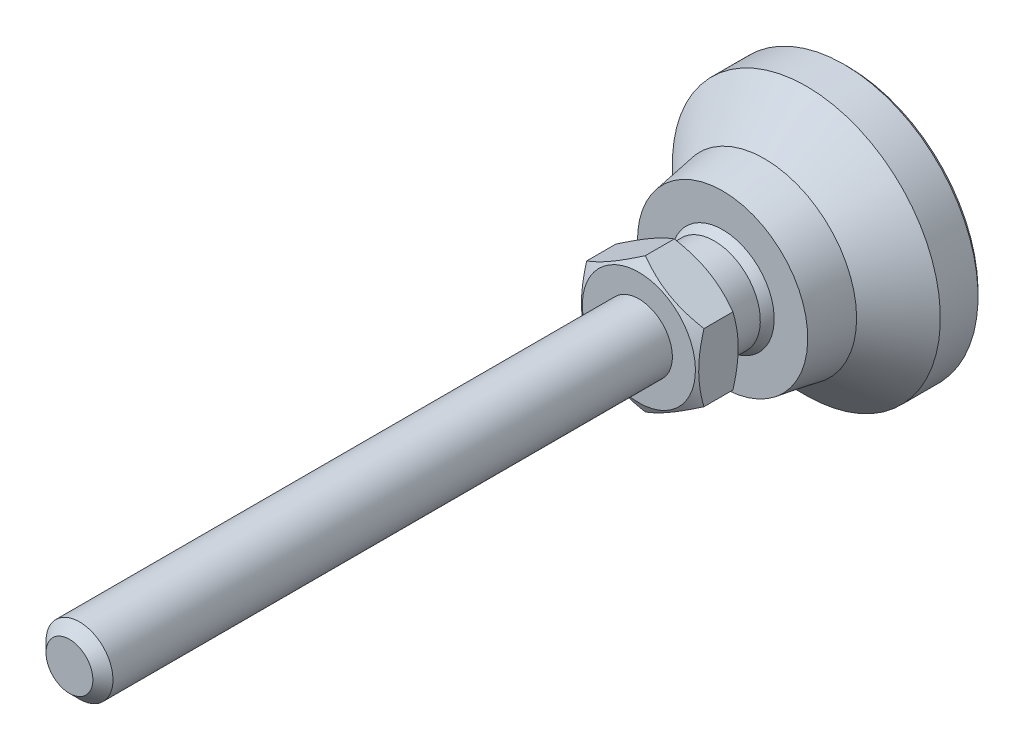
ISO-10303-21;
HEADER;
FILE_DESCRIPTION(('STEP AP214'),'2;1');
FILE_NAME('part.step','',(''),(''),'','','');
FILE_SCHEMA(('AUTOMOTIVE_DESIGN { 1 0 10303 214 1 1 1 1 }'));
ENDSEC;
DATA;
#1=APPLICATION_CONTEXT('core data for automotive mechanical design processes');
#2=APPLICATION_PROTOCOL_DEFINITION('international standard','automotive_design',2000,#1);
#3=PRODUCT_CONTEXT('',#1,'mechanical');
#4=PRODUCT('Part','Part','',(#3));
#5=PRODUCT_RELATED_PRODUCT_CATEGORY('part','',(#4));
#6=PRODUCT_DEFINITION_FORMATION('','',#4);
#7=PRODUCT_DEFINITION_CONTEXT('part definition',#1,'design');
#8=PRODUCT_DEFINITION('design','',#6,#7);
#9=PRODUCT_DEFINITION_SHAPE('','',#8);
#10=(LENGTH_UNIT() NAMED_UNIT(*) SI_UNIT(.MILLI.,.METRE.));
#11=(NAMED_UNIT(*) PLANE_ANGLE_UNIT() SI_UNIT($,.RADIAN.));
#12=(NAMED_UNIT(*) SI_UNIT($,.STERADIAN.) SOLID_ANGLE_UNIT());
#13=UNCERTAINTY_MEASURE_WITH_UNIT(LENGTH_MEASURE(1.E-05),#10,'distance_accuracy_value','');
#14=(GEOMETRIC_REPRESENTATION_CONTEXT(3) GLOBAL_UNCERTAINTY_ASSIGNED_CONTEXT((#13)) GLOBAL_UNIT_ASSIGNED_CONTEXT((#10,
#11,#12)) REPRESENTATION_CONTEXT('',''));
#15=CARTESIAN_POINT('',(0.,0.,0.));
#16=DIRECTION('',(0.,0.,1.));
#17=DIRECTION('',(1.,0.,0.));
#18=AXIS2_PLACEMENT_3D('',#15,#16,#17);
#19=CARTESIAN_POINT('',(0.,0.,0.));
#20=DIRECTION('',(0.,0.,-1.));
#21=DIRECTION('',(0.,1.,0.));
#22=AXIS2_PLACEMENT_3D('',#19,#20,#21);
#23=CYLINDRICAL_SURFACE('',#22,5.49999999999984);
#24=CARTESIAN_POINT('',(0.,0.,20.));
#25=DIRECTION('',(0.,0.,-1.));
#26=DIRECTION('',(0.,1.,0.));
#27=AXIS2_PLACEMENT_3D('',#24,#25,#26);
#28=CIRCLE('',#27,5.49999999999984);
#29=CARTESIAN_POINT('',(0.,5.49999999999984,20.));
#30=VERTEX_POINT('',#29);
#31=EDGE_CURVE('E111',#30,#30,#28,.T.);
#32=ORIENTED_EDGE('',*,*,#31,.T.);
#33=EDGE_LOOP('',(#32));
#34=FACE_BOUND('',#33,.T.);
#35=CARTESIAN_POINT('',(0.,0.,16.0000000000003));
#36=DIRECTION('',(0.,0.,1.));
#37=DIRECTION('',(0.,-1.,0.));
#38=AXIS2_PLACEMENT_3D('',#35,#36,#37);
#39=CIRCLE('',#38,5.49999999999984);
#40=CARTESIAN_POINT('',(-5.49999999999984,0.,16.0000000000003));
#41=VERTEX_POINT('',#40);
#42=EDGE_CURVE('E113',#41,#41,#39,.T.);
#43=ORIENTED_EDGE('',*,*,#42,.T.);
#44=EDGE_LOOP('',(#43));
#45=FACE_BOUND('',#44,.T.);
#46=ADVANCED_FACE('F14',(#34,#45),#23,.T.);
#47=CARTESIAN_POINT('',(0.,0.,11.6698729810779));
#48=DIRECTION('',(0.,0.,1.));
#49=DIRECTION('',(-1.,0.,0.));
#50=AXIS2_PLACEMENT_3D('',#47,#48,#49);
#51=SPHERICAL_SURFACE('',#50,7.);
#52=CARTESIAN_POINT('',(0.,0.,15.));
#53=DIRECTION('',(0.,0.,1.));
#54=DIRECTION('',(0.,-1.,0.));
#55=AXIS2_PLACEMENT_3D('',#52,#53,#54);
#56=CIRCLE('',#55,6.15713034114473);
#57=CARTESIAN_POINT('',(-6.15713034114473,0.,15.));
#58=VERTEX_POINT('',#57);
#59=EDGE_CURVE('E118',#58,#58,#56,.T.);
#60=CARTESIAN_POINT('',(-5.49999999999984,0.,16.0000000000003));
#61=CARTESIAN_POINT('',(-5.50771979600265,0.,15.9901945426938));
#62=CARTESIAN_POINT('',(-5.51541336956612,0.,15.9803684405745));
#63=CARTESIAN_POINT('',(-5.53074785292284,0.,15.9606752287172));
#64=CARTESIAN_POINT('',(-5.53838876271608,0.,15.9508081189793));
#65=CARTESIAN_POINT('',(-5.55361769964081,0.,15.9310331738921));
#66=CARTESIAN_POINT('',(-5.56120572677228,0.,15.9211253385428));
#67=CARTESIAN_POINT('',(-5.57632868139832,0.,15.9012692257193));
#68=CARTESIAN_POINT('',(-5.58386360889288,0.,15.8913209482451));
#69=CARTESIAN_POINT('',(-5.59888014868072,0.,15.871384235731));
#70=CARTESIAN_POINT('',(-5.60636176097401,0.,15.8613958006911));
#71=CARTESIAN_POINT('',(-5.62127145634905,0.,15.841379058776));
#72=CARTESIAN_POINT('',(-5.62869953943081,0.,15.8313507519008));
#73=CARTESIAN_POINT('',(-5.64350196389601,0.,15.81125455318));
#74=CARTESIAN_POINT('',(-5.65087630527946,0.,15.8011866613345));
#75=CARTESIAN_POINT('',(-5.66557103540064,0.,15.781011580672));
#76=CARTESIAN_POINT('',(-5.67289142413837,0.,15.770904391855));
#77=CARTESIAN_POINT('',(-5.68747803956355,0.,15.7506510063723));
#78=CARTESIAN_POINT('',(-5.69474426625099,0.,15.7405048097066));
#79=CARTESIAN_POINT('',(-5.70922234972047,0.,15.7201736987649));
#80=CARTESIAN_POINT('',(-5.7164342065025,0.,15.7099887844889));
#81=CARTESIAN_POINT('',(-5.7308033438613,0.,15.6895805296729));
#82=CARTESIAN_POINT('',(-5.73796062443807,0.,15.6793571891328));
#83=CARTESIAN_POINT('',(-5.75222040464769,0.,15.6588723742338));
#84=CARTESIAN_POINT('',(-5.75932290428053,0.,15.6486108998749));
#85=CARTESIAN_POINT('',(-5.77347291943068,0.,15.6280501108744));
#86=CARTESIAN_POINT('',(-5.78052043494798,0.,15.6177507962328));
#87=CARTESIAN_POINT('',(-5.79456028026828,0.,15.5971146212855));
#88=CARTESIAN_POINT('',(-5.80155261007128,0.,15.5867777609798));
#89=CARTESIAN_POINT('',(-5.81548188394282,0.,15.5660667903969));
#90=CARTESIAN_POINT('',(-5.82241882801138,0.,15.5556926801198));
#91=CARTESIAN_POINT('',(-5.83623713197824,0.,15.5349075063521));
#92=CARTESIAN_POINT('',(-5.84311849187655,0.,15.5244964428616));
#93=CARTESIAN_POINT('',(-5.85682543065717,0.,15.5036376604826));
#94=CARTESIAN_POINT('',(-5.86365100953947,0.,15.493189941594));
#95=CARTESIAN_POINT('',(-5.87724619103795,0.,15.4722581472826));
#96=CARTESIAN_POINT('',(-5.88401579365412,0.,15.4617740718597));
#97=CARTESIAN_POINT('',(-5.89749882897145,0.,15.4407698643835));
#98=CARTESIAN_POINT('',(-5.90421226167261,0.,15.4302497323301));
#99=CARTESIAN_POINT('',(-5.91758276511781,0.,15.4091737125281));
#100=CARTESIAN_POINT('',(-5.92423983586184,0.,15.3986178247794));
#101=CARTESIAN_POINT('',(-5.93749742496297,0.,15.3774705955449));
#102=CARTESIAN_POINT('',(-5.94409794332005,0.,15.366879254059));
#103=CARTESIAN_POINT('',(-5.95724223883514,0.,15.3456614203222));
#104=CARTESIAN_POINT('',(-5.96378601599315,0.,15.3350349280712));
#105=CARTESIAN_POINT('',(-5.9768166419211,0.,15.313747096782));
#106=CARTESIAN_POINT('',(-5.98330349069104,0.,15.3030857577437));
#107=CARTESIAN_POINT('',(-5.99622007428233,0.,15.2817285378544));
#108=CARTESIAN_POINT('',(-6.00264980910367,0.,15.2710326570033));
#109=CARTESIAN_POINT('',(-6.015451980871,0.,15.2496066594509));
#110=CARTESIAN_POINT('',(-6.02182441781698,0.,15.2388765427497));
#111=CARTESIAN_POINT('',(-6.034511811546,0.,15.217382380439));
#112=CARTESIAN_POINT('',(-6.04082676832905,0.,15.2066183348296));
#113=CARTESIAN_POINT('',(-6.05339902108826,0.,15.1850566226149));
#114=CARTESIAN_POINT('',(-6.05965631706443,0.,15.1742589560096));
#115=CARTESIAN_POINT('',(-6.07211306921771,0.,15.1526303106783));
#116=CARTESIAN_POINT('',(-6.07831252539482,0.,15.1417993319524));
#117=CARTESIAN_POINT('',(-6.09065342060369,0.,15.1201043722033));
#118=CARTESIAN_POINT('',(-6.09679485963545,0.,15.1092403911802));
#119=CARTESIAN_POINT('',(-6.10901954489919,0.,15.0874797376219));
#120=CARTESIAN_POINT('',(-6.11510279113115,0.,15.0765830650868));
#121=CARTESIAN_POINT('',(-6.12721091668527,0.,15.054757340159));
#122=CARTESIAN_POINT('',(-6.13323579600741,0.,15.0438282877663));
#123=CARTESIAN_POINT('',(-6.14522701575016,0.,15.0219381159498));
#124=CARTESIAN_POINT('',(-6.15119335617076,0.,15.010976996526));
#125=CARTESIAN_POINT('',(-6.15713034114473,0.,15.));
#126=B_SPLINE_CURVE_WITH_KNOTS('',3,(#60,#61,#62,#63,#64,#65,#66,#67,#68,#69,#70,#71,#72,#73,
#74,#75,#76,#77,#78,#79,#80,#81,#82,#83,#84,#85,#86,#87,#88,#89,#90,#91,#92,#93,#94,#95,#96,#97,
#98,#99,#100,#101,#102,#103,#104,#105,#106,#107,#108,#109,#110,#111,#112,#113,#114,#115,#116,
#117,#118,#119,#120,#121,#122,#123,#124,#125),.UNSPECIFIED.,.F.,.F.,(4,2,2,2,2,2,2,2,2,2,2,2,2,
2,2,2,2,2,2,2,2,2,2,2,2,2,2,2,2,2,2,2,4),(0.,0.0374389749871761,0.0748779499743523,
0.112316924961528,0.149755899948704,0.18719487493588,0.224633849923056,0.26207282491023,
0.299511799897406,0.336950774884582,0.374389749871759,0.411828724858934,0.449267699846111,
0.486706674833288,0.524145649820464,0.56158462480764,0.599023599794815,0.636462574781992,
0.673901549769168,0.711340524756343,0.74877949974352,0.786218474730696,0.823657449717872,
0.861096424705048,0.898535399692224,0.9359743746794,0.973413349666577,1.01085232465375,
1.04829129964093,1.0857302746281,1.12316924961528,1.16060822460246,1.19804719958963),.UNSPECIFIED.);
#127=EDGE_CURVE('BSEAM156',#41,#58,#126,.T.);
#128=ORIENTED_EDGE('',*,*,#42,.F.);
#129=ORIENTED_EDGE('',*,*,#59,.T.);
#130=ORIENTED_EDGE('',*,*,#127,.T.);
#131=ORIENTED_EDGE('',*,*,#127,.F.);
#132=EDGE_LOOP('',(#128,#130,#129,#131));
#133=FACE_BOUND('',#132,.T.);
#134=ADVANCED_FACE('F156',(#133),#51,.T.);
#135=CARTESIAN_POINT('',(-15.5,0.,0.));
#136=DIRECTION('',(0.,0.,1.));
#137=DIRECTION('',(0.,-1.,0.));
#138=AXIS2_PLACEMENT_3D('',#135,#136,#137);
#139=PLANE('',#138);
#140=CARTESIAN_POINT('',(0.,0.,0.));
#141=DIRECTION('',(0.,0.,-1.));
#142=DIRECTION('',(0.,1.,0.));
#143=AXIS2_PLACEMENT_3D('',#140,#141,#142);
#144=CIRCLE('',#143,15.5);
#145=CARTESIAN_POINT('',(0.,15.5,0.));
#146=VERTEX_POINT('',#145);
#147=EDGE_CURVE('E87',#146,#146,#144,.T.);
#148=ORIENTED_EDGE('',*,*,#147,.T.);
#149=EDGE_LOOP('',(#148));
#150=FACE_BOUND('',#149,.T.);
#151=ADVANCED_FACE('F161',(#150),#139,.F.);
#152=CARTESIAN_POINT('',(0.,0.,0.500000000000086));
#153=DIRECTION('',(0.,0.,1.));
#154=DIRECTION('',(0.,-1.,0.));
#155=AXIS2_PLACEMENT_3D('',#152,#153,#154);
#156=CONICAL_SURFACE('',#155,16.,0.785398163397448);
#157=ORIENTED_EDGE('',*,*,#147,.F.);
#158=EDGE_LOOP('',(#157));
#159=FACE_BOUND('',#158,.T.);
#160=CARTESIAN_POINT('',(0.,0.,0.500000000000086));
#161=DIRECTION('',(0.,0.,-1.));
#162=DIRECTION('',(0.,1.,0.));
#163=AXIS2_PLACEMENT_3D('',#160,#161,#162);
#164=CIRCLE('',#163,16.);
#165=CARTESIAN_POINT('',(0.,16.,0.500000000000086));
#166=VERTEX_POINT('',#165);
#167=EDGE_CURVE('E90',#166,#166,#164,.T.);
#168=ORIENTED_EDGE('',*,*,#167,.T.);
#169=EDGE_LOOP('',(#168));
#170=FACE_BOUND('',#169,.T.);
#171=ADVANCED_FACE('F171',(#159,#170),#156,.T.);
#172=CARTESIAN_POINT('',(0.,0.,0.));
#173=DIRECTION('',(0.,0.,-1.));
#174=DIRECTION('',(0.,1.,0.));
#175=AXIS2_PLACEMENT_3D('',#172,#173,#174);
#176=CYLINDRICAL_SURFACE('',#175,16.);
#177=ORIENTED_EDGE('',*,*,#167,.F.);
#178=EDGE_LOOP('',(#177));
#179=FACE_BOUND('',#178,.T.);
#180=CARTESIAN_POINT('',(0.,0.,5.00000000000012));
#181=DIRECTION('',(0.,0.,-1.));
#182=DIRECTION('',(0.,1.,0.));
#183=AXIS2_PLACEMENT_3D('',#180,#181,#182);
#184=CIRCLE('',#183,16.);
#185=CARTESIAN_POINT('',(0.,16.,5.00000000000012));
#186=VERTEX_POINT('',#185);
#187=EDGE_CURVE('E107',#186,#186,#184,.T.);
#188=ORIENTED_EDGE('',*,*,#187,.T.);
#189=EDGE_LOOP('',(#188));
#190=FACE_BOUND('',#189,.T.);
#191=ADVANCED_FACE('F167',(#179,#190),#176,.T.);
#192=CARTESIAN_POINT('',(0.,0.,10.));
#193=DIRECTION('',(0.,0.,-1.));
#194=DIRECTION('',(0.,1.,0.));
#195=AXIS2_PLACEMENT_3D('',#192,#193,#194);
#196=CONICAL_SURFACE('',#195,11.,0.785398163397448);
#197=ORIENTED_EDGE('',*,*,#187,.F.);
#198=EDGE_LOOP('',(#197));
#199=FACE_BOUND('',#198,.T.);
#200=CARTESIAN_POINT('',(0.,0.,10.));
#201=DIRECTION('',(0.,0.,-1.));
#202=DIRECTION('',(0.,1.,0.));
#203=AXIS2_PLACEMENT_3D('',#200,#201,#202);
#204=CIRCLE('',#203,11.);
#205=CARTESIAN_POINT('',(0.,11.,10.));
#206=VERTEX_POINT('',#205);
#207=EDGE_CURVE('E28',#206,#206,#204,.T.);
#208=ORIENTED_EDGE('',*,*,#207,.T.);
#209=EDGE_LOOP('',(#208));
#210=FACE_BOUND('',#209,.T.);
#211=ADVANCED_FACE('F150',(#199,#210),#196,.T.);
#212=CARTESIAN_POINT('',(0.,0.,16.));
#213=DIRECTION('',(0.,0.,-1.));
#214=DIRECTION('',(0.,1.,0.));
#215=AXIS2_PLACEMENT_3D('',#212,#213,#214);
#216=CONICAL_SURFACE('',#215,10.,0.165148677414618);
#217=ORIENTED_EDGE('',*,*,#207,.F.);
#218=EDGE_LOOP('',(#217));
#219=FACE_BOUND('',#218,.T.);
#220=CARTESIAN_POINT('',(0.,0.,15.));
#221=DIRECTION('',(0.,0.,-1.));
#222=DIRECTION('',(0.,1.,0.));
#223=AXIS2_PLACEMENT_3D('',#220,#221,#222);
#224=CIRCLE('',#223,10.1666666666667);
#225=CARTESIAN_POINT('',(0.,10.1666666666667,15.));
#226=VERTEX_POINT('',#225);
#227=EDGE_CURVE('E95',#226,#226,#224,.T.);
#228=ORIENTED_EDGE('',*,*,#227,.T.);
#229=EDGE_LOOP('',(#228));
#230=FACE_BOUND('',#229,.T.);
#231=ADVANCED_FACE('F135',(#219,#230),#216,.T.);
#232=CARTESIAN_POINT('',(-10.1666666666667,0.,15.));
#233=DIRECTION('',(0.,0.,1.));
#234=DIRECTION('',(0.,-1.,0.));
#235=AXIS2_PLACEMENT_3D('',#232,#233,#234);
#236=PLANE('',#235);
#237=ORIENTED_EDGE('',*,*,#227,.F.);
#238=EDGE_LOOP('',(#237));
#239=FACE_BOUND('',#238,.T.);
#240=ORIENTED_EDGE('',*,*,#59,.F.);
#241=EDGE_LOOP('',(#240));
#242=FACE_BOUND('',#241,.T.);
#243=ADVANCED_FACE('F137',(#239,#242),#236,.T.);
#244=CARTESIAN_POINT('',(0.,-8.08290376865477,20.));
#245=DIRECTION('',(0.,0.,-1.));
#246=DIRECTION('',(0.,1.,0.));
#247=AXIS2_PLACEMENT_3D('',#244,#245,#246);
#248=PLANE('',#247);
#249=CARTESIAN_POINT('',(0.,0.,20.));
#250=DIRECTION('',(0.,0.,1.));
#251=DIRECTION('',(0.,-1.,0.));
#252=AXIS2_PLACEMENT_3D('',#249,#250,#251);
#253=CIRCLE('',#252,6.75);
#254=CARTESIAN_POINT('',(0.,-6.75,20.));
#255=VERTEX_POINT('',#254);
#256=EDGE_CURVE('E81',#255,#255,#253,.T.);
#257=ORIENTED_EDGE('',*,*,#256,.F.);
#258=EDGE_LOOP('',(#257));
#259=FACE_BOUND('',#258,.T.);
#260=ORIENTED_EDGE('',*,*,#31,.F.);
#261=EDGE_LOOP('',(#260));
#262=FACE_BOUND('',#261,.T.);
#263=ADVANCED_FACE('F140',(#259,#262),#248,.T.);
#264=CARTESIAN_POINT('',(0.,0.,20.));
#265=DIRECTION('',(0.,0.,1.));
#266=DIRECTION('',(0.,-1.,0.));
#267=AXIS2_PLACEMENT_3D('',#264,#265,#266);
#268=CONICAL_SURFACE('',#267,6.75,1.0471975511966);
#269=CARTESIAN_POINT('',(7.0002,-4.04133641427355,20.7696190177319));
#270=CARTESIAN_POINT('',(6.84633209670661,-4.13017208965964,20.7183374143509));
#271=CARTESIAN_POINT('',(6.69189049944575,-4.21933898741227,20.669383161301));
#272=CARTESIAN_POINT('',(6.38175307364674,-4.3983969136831,20.5767703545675));
#273=CARTESIAN_POINT('',(6.22605673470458,-4.4882882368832,20.5331140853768));
#274=CARTESIAN_POINT('',(5.75647483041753,-4.7594014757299,20.4109491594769));
#275=CARTESIAN_POINT('',(5.4407356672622,-4.94169356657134,20.3414631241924));
#276=CARTESIAN_POINT('',(4.96823775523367,-5.21449036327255,20.2599825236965));
#277=CARTESIAN_POINT('',(4.81289077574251,-5.30417998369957,20.2367710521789));
#278=CARTESIAN_POINT('',(4.50149488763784,-5.48396448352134,20.1978487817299));
#279=CARTESIAN_POINT('',(4.34544604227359,-5.57405932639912,20.1821373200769));
#280=CARTESIAN_POINT('',(4.03307732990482,-5.75440548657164,20.1586154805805));
#281=CARTESIAN_POINT('',(3.87675797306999,-5.84465650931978,20.1507961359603));
#282=CARTESIAN_POINT('',(3.56398349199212,-6.02523694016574,20.1432178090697));
#283=CARTESIAN_POINT('',(3.40752837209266,-6.11556634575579,20.1434585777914));
#284=CARTESIAN_POINT('',(2.97889312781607,-6.36303901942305,20.155197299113));
#285=CARTESIAN_POINT('',(2.7068533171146,-6.52010127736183,20.1749033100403));
#286=CARTESIAN_POINT('',(2.16458055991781,-6.83318259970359,20.2373910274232));
#287=CARTESIAN_POINT('',(1.89434952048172,-6.98920056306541,20.2801940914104));
#288=CARTESIAN_POINT('',(1.35098545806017,-7.30291195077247,20.3871892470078));
#289=CARTESIAN_POINT('',(1.07792099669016,-7.46056579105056,20.4518346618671));
#290=CARTESIAN_POINT('',(0.535864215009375,-7.77352241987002,20.5985536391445));
#291=CARTESIAN_POINT('',(0.266864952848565,-7.92882921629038,20.680592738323));
#292=CARTESIAN_POINT('',(-0.000199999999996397,-8.08301923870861,20.7696190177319));
#293=B_SPLINE_CURVE_WITH_KNOTS('',3,(#269,#270,#271,#272,#273,#274,#275,#276,#277,#278,#279,
#280,#281,#282,#283,#284,#285,#286,#287,#288,#289,#290,#291,#292),.UNSPECIFIED.,.F.,.F.,(4,2,2,
2,2,2,2,2,2,2,2,4),(0.,0.554727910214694,1.10969417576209,2.2219327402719,2.76443041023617,
3.30688013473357,3.8487128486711,4.39052882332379,5.33376515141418,6.27787517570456,
7.24292418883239,8.20607866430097),.UNSPECIFIED.);
#294=CARTESIAN_POINT('',(7.,-4.04145188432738,20.7695523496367));
#295=VERTEX_POINT('',#294);
#296=CARTESIAN_POINT('',(0.,-8.08290376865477,20.7695523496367));
#297=VERTEX_POINT('',#296);
#298=EDGE_CURVE('E34',#295,#297,#293,.T.);
#299=ORIENTED_EDGE('',*,*,#298,.T.);
#300=CARTESIAN_POINT('',(0.000200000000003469,-8.0830192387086,20.7696190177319));
#301=CARTESIAN_POINT('',(-0.153667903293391,-7.99418356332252,20.7183374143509));
#302=CARTESIAN_POINT('',(-0.308109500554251,-7.90501666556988,20.669383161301));
#303=CARTESIAN_POINT('',(-0.618246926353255,-7.72595873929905,20.5767703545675));
#304=CARTESIAN_POINT('',(-0.773943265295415,-7.63606741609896,20.5331140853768));
#305=CARTESIAN_POINT('',(-1.24352516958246,-7.36495417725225,20.4109491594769));
#306=CARTESIAN_POINT('',(-1.5592643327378,-7.18266208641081,20.3414631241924));
#307=CARTESIAN_POINT('',(-2.03176224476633,-6.90986528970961,20.2599825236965));
#308=CARTESIAN_POINT('',(-2.18710922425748,-6.82017566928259,20.2367710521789));
#309=CARTESIAN_POINT('',(-2.49850511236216,-6.64039116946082,20.1978487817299));
#310=CARTESIAN_POINT('',(-2.6545539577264,-6.55029632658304,20.1821373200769));
#311=CARTESIAN_POINT('',(-2.96692267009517,-6.36995016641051,20.1586154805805));
#312=CARTESIAN_POINT('',(-3.12324202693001,-6.27969914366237,20.1507961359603));
#313=CARTESIAN_POINT('',(-3.43601650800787,-6.09911871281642,20.1432178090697));
#314=CARTESIAN_POINT('',(-3.59247162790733,-6.00878930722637,20.1434585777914));
#315=CARTESIAN_POINT('',(-4.02110687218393,-5.76131663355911,20.155197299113));
#316=CARTESIAN_POINT('',(-4.29314668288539,-5.60425437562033,20.1749033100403));
#317=CARTESIAN_POINT('',(-4.83541944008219,-5.29117305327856,20.2373910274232));
#318=CARTESIAN_POINT('',(-5.10565047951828,-5.13515508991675,20.2801940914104));
#319=CARTESIAN_POINT('',(-5.64901454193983,-4.82144370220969,20.3871892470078));
#320=CARTESIAN_POINT('',(-5.92207900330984,-4.6637898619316,20.4518346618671));
#321=CARTESIAN_POINT('',(-6.46413578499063,-4.35083323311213,20.5985536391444));
#322=CARTESIAN_POINT('',(-6.73313504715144,-4.19552643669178,20.680592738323));
#323=CARTESIAN_POINT('',(-7.0002,-4.04133641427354,20.7696190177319));
#324=B_SPLINE_CURVE_WITH_KNOTS('',3,(#300,#301,#302,#303,#304,#305,#306,#307,#308,#309,#310,
#311,#312,#313,#314,#315,#316,#317,#318,#319,#320,#321,#322,#323),.UNSPECIFIED.,.F.,.F.,(4,2,2,
2,2,2,2,2,2,2,2,4),(0.,0.554727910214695,1.10969417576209,2.2219327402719,2.76443041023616,
3.30688013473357,3.84871284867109,4.39052882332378,5.33376515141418,6.27787517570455,
7.2429241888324,8.20607866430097),.UNSPECIFIED.);
#325=CARTESIAN_POINT('',(-7.,-4.04145188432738,20.7695523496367));
#326=VERTEX_POINT('',#325);
#327=EDGE_CURVE('E9',#297,#326,#324,.T.);
#328=ORIENTED_EDGE('',*,*,#327,.T.);
#329=CARTESIAN_POINT('',(-7.,10.818512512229,23.5424244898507));
#330=CARTESIAN_POINT('',(-7.,10.513086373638,23.394415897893));
#331=CARTESIAN_POINT('',(-7.,10.2069550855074,23.2478373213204));
#332=CARTESIAN_POINT('',(-7.,9.5929070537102,22.9583452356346));
#333=CARTESIAN_POINT('',(-7.,9.28499003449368,22.8154323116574));
#334=CARTESIAN_POINT('',(-7.,8.66539093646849,22.5333495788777));
#335=CARTESIAN_POINT('',(-7.,8.35369746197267,22.3942047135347));
#336=CARTESIAN_POINT('',(-7.,7.72781834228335,22.1216594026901));
#337=CARTESIAN_POINT('',(-7.,7.413632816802,21.9882586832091));
#338=CARTESIAN_POINT('',(-7.,6.77227563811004,21.7246111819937));
#339=CARTESIAN_POINT('',(-7.,6.44500757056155,21.5945976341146));
#340=CARTESIAN_POINT('',(-7.,5.7866296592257,21.344501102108));
#341=CARTESIAN_POINT('',(-7.,5.45551938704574,21.2244192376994));
#342=CARTESIAN_POINT('',(-7.,4.78955817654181,20.9973662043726));
#343=CARTESIAN_POINT('',(-7.,4.4547164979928,20.8903681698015));
#344=CARTESIAN_POINT('',(-7.,3.78024246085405,20.6929392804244));
#345=CARTESIAN_POINT('',(-7.,3.44061165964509,20.6025031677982));
#346=CARTESIAN_POINT('',(-7.,2.75818647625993,20.4430474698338));
#347=CARTESIAN_POINT('',(-7.,2.4154196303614,20.3739132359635));
#348=CARTESIAN_POINT('',(-7.,1.89817810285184,20.2892002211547));
#349=CARTESIAN_POINT('',(-7.,1.72523606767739,20.2641261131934));
#350=CARTESIAN_POINT('',(-7.,1.37850513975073,20.2207999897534));
#351=CARTESIAN_POINT('',(-7.,1.20471633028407,20.2025473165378));
#352=CARTESIAN_POINT('',(-7.,0.858778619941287,20.1734546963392));
#353=CARTESIAN_POINT('',(-7.,0.68663754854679,20.1625220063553));
#354=CARTESIAN_POINT('',(-7.,0.342047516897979,20.1479433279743));
#355=CARTESIAN_POINT('',(-7.,0.169598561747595,20.1442972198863));
#356=CARTESIAN_POINT('',(-7.,-0.175299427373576,20.1443785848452));
#357=CARTESIAN_POINT('',(-7.,-0.347748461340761,20.1481060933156));
#358=CARTESIAN_POINT('',(-7.,-0.69233726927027,20.1628442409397));
#359=CARTESIAN_POINT('',(-7.,-0.864477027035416,20.173855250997));
#360=CARTESIAN_POINT('',(-7.,-1.27931862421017,20.208935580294));
#361=CARTESIAN_POINT('',(-7.,-1.52172905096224,20.2365237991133));
#362=CARTESIAN_POINT('',(-7.,-2.00471472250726,20.3046300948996));
#363=CARTESIAN_POINT('',(-7.,-2.24528970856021,20.3451499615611));
#364=CARTESIAN_POINT('',(-7.,-2.96400663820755,20.483955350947));
#365=CARTESIAN_POINT('',(-7.,-3.4388649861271,20.5994603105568));
#366=CARTESIAN_POINT('',(-7.,-4.14885738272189,20.7993038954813));
#367=CARTESIAN_POINT('',(-7.,-4.38768544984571,20.8712695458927));
#368=CARTESIAN_POINT('',(-7.,-4.86302113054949,21.0225627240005));
#369=CARTESIAN_POINT('',(-7.,-5.09952872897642,21.101890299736));
#370=CARTESIAN_POINT('',(-7.,-5.57030006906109,21.2666439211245));
#371=CARTESIAN_POINT('',(-7.,-5.80456454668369,21.3520678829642));
#372=CARTESIAN_POINT('',(-7.,-6.2711601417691,21.5280204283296));
#373=CARTESIAN_POINT('',(-7.,-6.50349128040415,21.6185489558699));
#374=CARTESIAN_POINT('',(-7.,-7.04574974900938,21.8356094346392));
#375=CARTESIAN_POINT('',(-7.,-7.35499166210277,21.9638503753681));
#376=CARTESIAN_POINT('',(-7.,-7.97089833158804,22.226395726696));
#377=CARTESIAN_POINT('',(-7.,-8.27756293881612,22.360700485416));
#378=CARTESIAN_POINT('',(-7.,-8.88878114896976,22.6341726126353));
#379=CARTESIAN_POINT('',(-7.,-9.19333433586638,22.7733409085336));
#380=CARTESIAN_POINT('',(-7.,-9.80062987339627,23.0555808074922));
#381=CARTESIAN_POINT('',(-7.,-10.1033721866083,23.1986524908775));
#382=CARTESIAN_POINT('',(-7.,-10.7076430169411,23.488121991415));
#383=CARTESIAN_POINT('',(-7.,-11.0091699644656,23.6345230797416));
#384=CARTESIAN_POINT('',(-7.,-11.6109362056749,23.9299505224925));
#385=CARTESIAN_POINT('',(-7.,-11.9111754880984,24.0789768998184));
#386=CARTESIAN_POINT('',(-7.,-12.8101895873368,24.5292664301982));
#387=CARTESIAN_POINT('',(-7.,-13.4073376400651,24.8337771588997));
#388=CARTESIAN_POINT('',(-7.,-14.5495136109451,25.4236329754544));
#389=CARTESIAN_POINT('',(-7.,-15.0947914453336,25.7084962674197));
#390=CARTESIAN_POINT('',(-7.,-16.1833163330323,26.2821180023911));
#391=CARTESIAN_POINT('',(-7.,-16.7265633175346,26.5708765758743));
#392=CARTESIAN_POINT('',(-7.,-17.8101621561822,27.1506673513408));
#393=CARTESIAN_POINT('',(-7.,-18.3505178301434,27.4416924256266));
#394=CARTESIAN_POINT('',(-7.,-19.4299272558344,28.0260796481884));
#395=CARTESIAN_POINT('',(-7.,-19.9689810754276,28.31944167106));
#396=CARTESIAN_POINT('',(-7.,-20.50755401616,28.6136779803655));
#397=B_SPLINE_CURVE_WITH_KNOTS('',3,(#329,#330,#331,#332,#333,#334,#335,#336,#337,#338,#339,
#340,#341,#342,#343,#344,#345,#346,#347,#348,#349,#350,#351,#352,#353,#354,#355,#356,#357,#358,
#359,#360,#361,#362,#363,#364,#365,#366,#367,#368,#369,#370,#371,#372,#373,#374,#375,#376,#377,
#378,#379,#380,#381,#382,#383,#384,#385,#386,#387,#388,#389,#390,#391,#392,#393,#394,#395,#396),
.UNSPECIFIED.,.F.,.F.,(4,2,2,2,2,2,2,2,2,2,2,2,2,2,2,2,2,2,2,2,2,2,2,2,2,2,2,2,2,2,2,2,2,4),(0.,
1.0182095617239,2.03658065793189,3.06055915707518,4.0844887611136,5.1408064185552,
6.19724300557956,7.25147257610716,8.30536688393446,9.3534857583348,9.87762319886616,
10.4017100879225,10.9190244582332,11.4363303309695,11.9536386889,12.4709733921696,
13.2024850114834,13.9340979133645,15.3981504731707,16.1463949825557,16.8946443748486,
17.6426392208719,18.3906258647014,19.3948732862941,20.3991784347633,21.4036761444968,
22.4081945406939,23.4137466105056,24.4193074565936,26.4301727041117,28.2757655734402,
30.1214204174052,31.9626417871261,33.8037650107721),.UNSPECIFIED.);
#398=CARTESIAN_POINT('',(-7.,4.04145188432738,20.7695523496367));
#399=VERTEX_POINT('',#398);
#400=EDGE_CURVE('E73',#326,#399,#397,.F.);
#401=ORIENTED_EDGE('',*,*,#400,.T.);
#402=CARTESIAN_POINT('',(-7.0002,4.04133641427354,20.7696190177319));
#403=CARTESIAN_POINT('',(-6.84633209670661,4.13017208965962,20.7183374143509));
#404=CARTESIAN_POINT('',(-6.69189049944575,4.21933898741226,20.669383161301));
#405=CARTESIAN_POINT('',(-6.38175307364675,4.39839691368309,20.5767703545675));
#406=CARTESIAN_POINT('',(-6.22605673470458,4.48828823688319,20.5331140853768));
#407=CARTESIAN_POINT('',(-5.75647483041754,4.75940147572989,20.4109491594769));
#408=CARTESIAN_POINT('',(-5.4407356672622,4.94169356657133,20.3414631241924));
#409=CARTESIAN_POINT('',(-4.96823775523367,5.21449036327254,20.2599825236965));
#410=CARTESIAN_POINT('',(-4.81289077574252,5.30417998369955,20.2367710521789));
#411=CARTESIAN_POINT('',(-4.50149488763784,5.48396448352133,20.1978487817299));
#412=CARTESIAN_POINT('',(-4.34544604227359,5.57405932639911,20.1821373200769));
#413=CARTESIAN_POINT('',(-4.03307732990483,5.75440548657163,20.1586154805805));
#414=CARTESIAN_POINT('',(-3.87675797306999,5.84465650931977,20.1507961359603));
#415=CARTESIAN_POINT('',(-3.56398349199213,6.02523694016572,20.1432178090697));
#416=CARTESIAN_POINT('',(-3.40752837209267,6.11556634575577,20.1434585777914));
#417=CARTESIAN_POINT('',(-2.97889312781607,6.36303901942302,20.155197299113));
#418=CARTESIAN_POINT('',(-2.7068533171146,6.52010127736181,20.1749033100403));
#419=CARTESIAN_POINT('',(-2.16458055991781,6.83318259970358,20.2373910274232));
#420=CARTESIAN_POINT('',(-1.89434952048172,6.9892005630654,20.2801940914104));
#421=CARTESIAN_POINT('',(-1.35098545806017,7.30291195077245,20.3871892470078));
#422=CARTESIAN_POINT('',(-1.07792099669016,7.46056579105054,20.4518346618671));
#423=CARTESIAN_POINT('',(-0.535864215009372,7.77352241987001,20.5985536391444));
#424=CARTESIAN_POINT('',(-0.266864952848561,7.92882921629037,20.680592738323));
#425=CARTESIAN_POINT('',(0.000199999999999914,8.0830192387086,20.7696190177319));
#426=B_SPLINE_CURVE_WITH_KNOTS('',3,(#402,#403,#404,#405,#406,#407,#408,#409,#410,#411,#412,
#413,#414,#415,#416,#417,#418,#419,#420,#421,#422,#423,#424,#425),.UNSPECIFIED.,.F.,.F.,(4,2,2,
2,2,2,2,2,2,2,2,4),(0.,0.554727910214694,1.10969417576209,2.2219327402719,2.76443041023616,
3.30688013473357,3.84871284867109,4.39052882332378,5.33376515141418,6.27787517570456,
7.2429241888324,8.20607866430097),.UNSPECIFIED.);
#427=CARTESIAN_POINT('',(0.,8.08290376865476,20.7695523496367));
#428=VERTEX_POINT('',#427);
#429=EDGE_CURVE('E80',#399,#428,#426,.T.);
#430=ORIENTED_EDGE('',*,*,#429,.T.);
#431=CARTESIAN_POINT('',(-0.000200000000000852,8.0830192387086,20.7696190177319));
#432=CARTESIAN_POINT('',(0.15366790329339,7.99418356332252,20.7183374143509));
#433=CARTESIAN_POINT('',(0.308109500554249,7.90501666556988,20.669383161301));
#434=CARTESIAN_POINT('',(0.618246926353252,7.72595873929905,20.5767703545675));
#435=CARTESIAN_POINT('',(0.773943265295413,7.63606741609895,20.5331140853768));
#436=CARTESIAN_POINT('',(1.24352516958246,7.36495417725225,20.4109491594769));
#437=CARTESIAN_POINT('',(1.5592643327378,7.18266208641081,20.3414631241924));
#438=CARTESIAN_POINT('',(2.03176224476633,6.9098652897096,20.2599825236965));
#439=CARTESIAN_POINT('',(2.18710922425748,6.82017566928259,20.2367710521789));
#440=CARTESIAN_POINT('',(2.49850511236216,6.64039116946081,20.1978487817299));
#441=CARTESIAN_POINT('',(2.65455395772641,6.55029632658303,20.1821373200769));
#442=CARTESIAN_POINT('',(2.96692267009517,6.36995016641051,20.1586154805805));
#443=CARTESIAN_POINT('',(3.12324202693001,6.27969914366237,20.1507961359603));
#444=CARTESIAN_POINT('',(3.43601650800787,6.09911871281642,20.1432178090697));
#445=CARTESIAN_POINT('',(3.59247162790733,6.00878930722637,20.1434585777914));
#446=CARTESIAN_POINT('',(4.02110687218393,5.76131663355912,20.155197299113));
#447=CARTESIAN_POINT('',(4.2931466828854,5.60425437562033,20.1749033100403));
#448=CARTESIAN_POINT('',(4.83541944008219,5.29117305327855,20.2373910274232));
#449=CARTESIAN_POINT('',(5.10565047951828,5.13515508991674,20.2801940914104));
#450=CARTESIAN_POINT('',(5.64901454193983,4.82144370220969,20.3871892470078));
#451=CARTESIAN_POINT('',(5.92207900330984,4.66378986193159,20.4518346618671));
#452=CARTESIAN_POINT('',(6.46413578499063,4.35083323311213,20.5985536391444));
#453=CARTESIAN_POINT('',(6.73313504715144,4.19552643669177,20.680592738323));
#454=CARTESIAN_POINT('',(7.0002,4.04133641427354,20.7696190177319));
#455=B_SPLINE_CURVE_WITH_KNOTS('',3,(#431,#432,#433,#434,#435,#436,#437,#438,#439,#440,#441,
#442,#443,#444,#445,#446,#447,#448,#449,#450,#451,#452,#453,#454),.UNSPECIFIED.,.F.,.F.,(4,2,2,
2,2,2,2,2,2,2,2,4),(0.,0.554727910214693,1.10969417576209,2.2219327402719,2.76443041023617,
3.30688013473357,3.8487128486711,4.39052882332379,5.33376515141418,6.27787517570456,
7.2429241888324,8.20607866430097),.UNSPECIFIED.);
#456=CARTESIAN_POINT('',(7.,4.04145188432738,20.7695523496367));
#457=VERTEX_POINT('',#456);
#458=EDGE_CURVE('E255',#428,#457,#455,.T.);
#459=ORIENTED_EDGE('',*,*,#458,.T.);
#460=CARTESIAN_POINT('',(7.,10.818512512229,23.5424244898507));
#461=CARTESIAN_POINT('',(7.,10.513086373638,23.394415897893));
#462=CARTESIAN_POINT('',(7.,10.2069550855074,23.2478373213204));
#463=CARTESIAN_POINT('',(7.,9.5929070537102,22.9583452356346));
#464=CARTESIAN_POINT('',(7.,9.28499003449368,22.8154323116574));
#465=CARTESIAN_POINT('',(7.,8.66539093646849,22.5333495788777));
#466=CARTESIAN_POINT('',(7.,8.35369746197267,22.3942047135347));
#467=CARTESIAN_POINT('',(7.,7.72781834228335,22.1216594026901));
#468=CARTESIAN_POINT('',(7.,7.413632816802,21.9882586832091));
#469=CARTESIAN_POINT('',(7.,6.77227563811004,21.7246111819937));
#470=CARTESIAN_POINT('',(7.,6.44500757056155,21.5945976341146));
#471=CARTESIAN_POINT('',(7.,5.7866296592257,21.344501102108));
#472=CARTESIAN_POINT('',(7.,5.45551938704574,21.2244192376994));
#473=CARTESIAN_POINT('',(7.,4.78955817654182,20.9973662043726));
#474=CARTESIAN_POINT('',(7.,4.4547164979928,20.8903681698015));
#475=CARTESIAN_POINT('',(7.,3.78024246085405,20.6929392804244));
#476=CARTESIAN_POINT('',(7.,3.44061165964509,20.6025031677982));
#477=CARTESIAN_POINT('',(7.,2.75818647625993,20.4430474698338));
#478=CARTESIAN_POINT('',(7.,2.4154196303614,20.3739132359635));
#479=CARTESIAN_POINT('',(7.,1.89817810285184,20.2892002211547));
#480=CARTESIAN_POINT('',(7.,1.72523606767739,20.2641261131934));
#481=CARTESIAN_POINT('',(7.,1.37850513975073,20.2207999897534));
#482=CARTESIAN_POINT('',(7.,1.20471633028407,20.2025473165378));
#483=CARTESIAN_POINT('',(7.,0.858778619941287,20.1734546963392));
#484=CARTESIAN_POINT('',(7.,0.68663754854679,20.1625220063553));
#485=CARTESIAN_POINT('',(7.,0.342047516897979,20.1479433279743));
#486=CARTESIAN_POINT('',(7.,0.169598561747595,20.1442972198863));
#487=CARTESIAN_POINT('',(7.,-0.175299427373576,20.1443785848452));
#488=CARTESIAN_POINT('',(7.,-0.347748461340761,20.1481060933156));
#489=CARTESIAN_POINT('',(7.,-0.69233726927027,20.1628442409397));
#490=CARTESIAN_POINT('',(7.,-0.864477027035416,20.173855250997));
#491=CARTESIAN_POINT('',(7.,-1.27931862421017,20.208935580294));
#492=CARTESIAN_POINT('',(7.,-1.52172905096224,20.2365237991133));
#493=CARTESIAN_POINT('',(7.,-2.00471472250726,20.3046300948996));
#494=CARTESIAN_POINT('',(7.,-2.24528970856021,20.3451499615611));
#495=CARTESIAN_POINT('',(7.,-2.96400663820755,20.483955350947));
#496=CARTESIAN_POINT('',(7.,-3.4388649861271,20.5994603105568));
#497=CARTESIAN_POINT('',(7.,-4.14885738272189,20.7993038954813));
#498=CARTESIAN_POINT('',(7.,-4.38768544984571,20.8712695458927));
#499=CARTESIAN_POINT('',(7.,-4.86302113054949,21.0225627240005));
#500=CARTESIAN_POINT('',(7.,-5.09952872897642,21.101890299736));
#501=CARTESIAN_POINT('',(7.,-5.57030006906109,21.2666439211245));
#502=CARTESIAN_POINT('',(7.,-5.80456454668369,21.3520678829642));
#503=CARTESIAN_POINT('',(7.,-6.2711601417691,21.5280204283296));
#504=CARTESIAN_POINT('',(7.,-6.50349128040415,21.6185489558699));
#505=CARTESIAN_POINT('',(7.,-7.04574974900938,21.8356094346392));
#506=CARTESIAN_POINT('',(7.,-7.35499166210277,21.9638503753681));
#507=CARTESIAN_POINT('',(7.,-7.97089833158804,22.226395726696));
#508=CARTESIAN_POINT('',(7.,-8.27756293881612,22.360700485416));
#509=CARTESIAN_POINT('',(7.,-8.88878114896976,22.6341726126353));
#510=CARTESIAN_POINT('',(7.,-9.19333433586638,22.7733409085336));
#511=CARTESIAN_POINT('',(7.,-9.80062987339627,23.0555808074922));
#512=CARTESIAN_POINT('',(7.,-10.1033721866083,23.1986524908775));
#513=CARTESIAN_POINT('',(7.,-10.7076430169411,23.488121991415));
#514=CARTESIAN_POINT('',(7.,-11.0091699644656,23.6345230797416));
#515=CARTESIAN_POINT('',(7.,-11.6109362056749,23.9299505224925));
#516=CARTESIAN_POINT('',(7.,-11.9111754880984,24.0789768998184));
#517=CARTESIAN_POINT('',(7.,-12.8101895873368,24.5292664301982));
#518=CARTESIAN_POINT('',(7.,-13.4073376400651,24.8337771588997));
#519=CARTESIAN_POINT('',(7.,-14.5495136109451,25.4236329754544));
#520=CARTESIAN_POINT('',(7.,-15.0947914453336,25.7084962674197));
#521=CARTESIAN_POINT('',(7.,-16.1833163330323,26.2821180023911));
#522=CARTESIAN_POINT('',(7.,-16.7265633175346,26.5708765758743));
#523=CARTESIAN_POINT('',(7.,-17.8101621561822,27.1506673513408));
#524=CARTESIAN_POINT('',(7.,-18.3505178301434,27.4416924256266));
#525=CARTESIAN_POINT('',(7.,-19.4299272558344,28.0260796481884));
#526=CARTESIAN_POINT('',(7.,-19.9689810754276,28.31944167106));
#527=CARTESIAN_POINT('',(7.,-20.50755401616,28.6136779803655));
#528=B_SPLINE_CURVE_WITH_KNOTS('',3,(#460,#461,#462,#463,#464,#465,#466,#467,#468,#469,#470,
#471,#472,#473,#474,#475,#476,#477,#478,#479,#480,#481,#482,#483,#484,#485,#486,#487,#488,#489,
#490,#491,#492,#493,#494,#495,#496,#497,#498,#499,#500,#501,#502,#503,#504,#505,#506,#507,#508,
#509,#510,#511,#512,#513,#514,#515,#516,#517,#518,#519,#520,#521,#522,#523,#524,#525,#526,#527),
.UNSPECIFIED.,.F.,.F.,(4,2,2,2,2,2,2,2,2,2,2,2,2,2,2,2,2,2,2,2,2,2,2,2,2,2,2,2,2,2,2,2,2,4),(0.,
1.0182095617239,2.03658065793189,3.06055915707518,4.08448876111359,5.1408064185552,
6.19724300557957,7.25147257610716,8.30536688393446,9.3534857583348,9.87762319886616,
10.4017100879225,10.9190244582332,11.4363303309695,11.9536386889,12.4709733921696,
13.2024850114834,13.9340979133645,15.3981504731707,16.1463949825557,16.8946443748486,
17.6426392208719,18.3906258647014,19.3948732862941,20.3991784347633,21.4036761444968,
22.4081945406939,23.4137466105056,24.4193074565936,26.4301727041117,28.2757655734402,
30.1214204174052,31.9626417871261,33.8037650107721),.UNSPECIFIED.);
#529=EDGE_CURVE('E249',#457,#295,#528,.T.);
#530=ORIENTED_EDGE('',*,*,#529,.T.);
#531=EDGE_LOOP('',(#299,#328,#401,#430,#459,#530));
#532=FACE_BOUND('',#531,.T.);
#533=ORIENTED_EDGE('',*,*,#256,.T.);
#534=EDGE_LOOP('',(#533));
#535=FACE_BOUND('',#534,.T.);
#536=ADVANCED_FACE('F71',(#532,#535),#268,.T.);
#537=CARTESIAN_POINT('',(0.,0.,93.));
#538=DIRECTION('',(0.,0.,-1.));
#539=DIRECTION('',(0.,1.,0.));
#540=AXIS2_PLACEMENT_3D('',#537,#538,#539);
#541=PLANE('',#540);
#542=CARTESIAN_POINT('',(0.,0.,93.));
#543=DIRECTION('',(0.,0.,1.));
#544=DIRECTION('',(0.,-1.,0.));
#545=AXIS2_PLACEMENT_3D('',#542,#543,#544);
#546=CIRCLE('',#545,2.79999999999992);
#547=CARTESIAN_POINT('',(0.,-2.79999999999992,93.));
#548=VERTEX_POINT('',#547);
#549=EDGE_CURVE('E121',#548,#548,#546,.T.);
#550=ORIENTED_EDGE('',*,*,#549,.T.);
#551=EDGE_LOOP('',(#550));
#552=FACE_BOUND('',#551,.T.);
#553=ADVANCED_FACE('F277',(#552),#541,.F.);
#554=CARTESIAN_POINT('',(0.,0.,91.8));
#555=DIRECTION('',(0.,0.,-1.));
#556=DIRECTION('',(0.,1.,0.));
#557=AXIS2_PLACEMENT_3D('',#554,#555,#556);
#558=CONICAL_SURFACE('',#557,3.99999999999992,0.785398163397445);
#559=ORIENTED_EDGE('',*,*,#549,.F.);
#560=EDGE_LOOP('',(#559));
#561=FACE_BOUND('',#560,.T.);
#562=CARTESIAN_POINT('',(0.,0.,91.8));
#563=DIRECTION('',(0.,0.,1.));
#564=DIRECTION('',(0.,-1.,0.));
#565=AXIS2_PLACEMENT_3D('',#562,#563,#564);
#566=CIRCLE('',#565,3.99999999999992);
#567=CARTESIAN_POINT('',(0.,-3.99999999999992,91.8));
#568=VERTEX_POINT('',#567);
#569=EDGE_CURVE('E126',#568,#568,#566,.T.);
#570=ORIENTED_EDGE('',*,*,#569,.T.);
#571=EDGE_LOOP('',(#570));
#572=FACE_BOUND('',#571,.T.);
#573=ADVANCED_FACE('F208',(#561,#572),#558,.T.);
#574=CARTESIAN_POINT('',(0.,0.,0.));
#575=DIRECTION('',(0.,0.,-1.));
#576=DIRECTION('',(0.,1.,0.));
#577=AXIS2_PLACEMENT_3D('',#574,#575,#576);
#578=CYLINDRICAL_SURFACE('',#577,3.99999999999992);
#579=ORIENTED_EDGE('',*,*,#569,.F.);
#580=EDGE_LOOP('',(#579));
#581=FACE_BOUND('',#580,.T.);
#582=CARTESIAN_POINT('',(0.,0.,25.));
#583=DIRECTION('',(0.,0.,1.));
#584=DIRECTION('',(0.,-1.,0.));
#585=AXIS2_PLACEMENT_3D('',#582,#583,#584);
#586=CIRCLE('',#585,3.99999999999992);
#587=CARTESIAN_POINT('',(0.,-3.99999999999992,25.));
#588=VERTEX_POINT('',#587);
#589=EDGE_CURVE('E114',#588,#588,#586,.T.);
#590=ORIENTED_EDGE('',*,*,#589,.T.);
#591=EDGE_LOOP('',(#590));
#592=FACE_BOUND('',#591,.T.);
#593=ADVANCED_FACE('F16',(#581,#592),#578,.T.);
#594=CARTESIAN_POINT('',(-7.,12.1243556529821,25.));
#595=DIRECTION('',(0.,0.,-1.));
#596=DIRECTION('',(0.,1.,0.));
#597=AXIS2_PLACEMENT_3D('',#594,#595,#596);
#598=PLANE('',#597);
#599=CARTESIAN_POINT('',(0.,0.,25.));
#600=DIRECTION('',(0.,0.,1.));
#601=DIRECTION('',(0.,-1.,0.));
#602=AXIS2_PLACEMENT_3D('',#599,#600,#601);
#603=CIRCLE('',#602,6.75);
#604=CARTESIAN_POINT('',(0.,-6.75,25.));
#605=VERTEX_POINT('',#604);
#606=EDGE_CURVE('E195',#605,#605,#603,.T.);
#607=ORIENTED_EDGE('',*,*,#606,.T.);
#608=EDGE_LOOP('',(#607));
#609=FACE_BOUND('',#608,.T.);
#610=ORIENTED_EDGE('',*,*,#589,.F.);
#611=EDGE_LOOP('',(#610));
#612=FACE_BOUND('',#611,.T.);
#613=ADVANCED_FACE('F205',(#609,#612),#598,.F.);
#614=CARTESIAN_POINT('',(0.,0.,23.3675541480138));
#615=DIRECTION('',(0.,0.,-1.));
#616=DIRECTION('',(0.,1.,0.));
#617=AXIS2_PLACEMENT_3D('',#614,#615,#616);
#618=CONICAL_SURFACE('',#617,9.57747915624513,1.0471975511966);
#619=CARTESIAN_POINT('',(-0.000199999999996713,-8.08301923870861,24.2303809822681));
#620=CARTESIAN_POINT('',(0.153667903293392,-7.99418356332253,24.2816625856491));
#621=CARTESIAN_POINT('',(0.30810950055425,-7.90501666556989,24.330616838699));
#622=CARTESIAN_POINT('',(0.618246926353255,-7.72595873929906,24.4232296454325));
#623=CARTESIAN_POINT('',(0.773943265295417,-7.63606741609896,24.4668859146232));
#624=CARTESIAN_POINT('',(1.24352516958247,-7.36495417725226,24.5890508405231));
#625=CARTESIAN_POINT('',(1.5592643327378,-7.18266208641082,24.6585368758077));
#626=CARTESIAN_POINT('',(2.03176224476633,-6.90986528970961,24.7400174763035));
#627=CARTESIAN_POINT('',(2.18710922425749,-6.8201756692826,24.7632289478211));
#628=CARTESIAN_POINT('',(2.49850511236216,-6.64039116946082,24.8021512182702));
#629=CARTESIAN_POINT('',(2.65455395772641,-6.55029632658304,24.8178626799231));
#630=CARTESIAN_POINT('',(2.96692267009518,-6.36995016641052,24.8413845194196));
#631=CARTESIAN_POINT('',(3.12324202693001,-6.27969914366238,24.8492038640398));
#632=CARTESIAN_POINT('',(3.43601650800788,-6.09911871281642,24.8567821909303));
#633=CARTESIAN_POINT('',(3.59247162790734,-6.00878930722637,24.8565414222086));
#634=CARTESIAN_POINT('',(4.02110687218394,-5.76131663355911,24.844802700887));
#635=CARTESIAN_POINT('',(4.2931466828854,-5.60425437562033,24.8250966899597));
#636=CARTESIAN_POINT('',(4.8354194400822,-5.29117305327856,24.7626089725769));
#637=CARTESIAN_POINT('',(5.10565047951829,-5.13515508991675,24.7198059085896));
#638=CARTESIAN_POINT('',(5.64901454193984,-4.82144370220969,24.6128107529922));
#639=CARTESIAN_POINT('',(5.92207900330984,-4.6637898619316,24.5481653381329));
#640=CARTESIAN_POINT('',(6.46413578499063,-4.35083323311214,24.4014463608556));
#641=CARTESIAN_POINT('',(6.73313504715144,-4.19552643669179,24.319407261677));
#642=CARTESIAN_POINT('',(7.0002,-4.04133641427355,24.2303809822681));
#643=B_SPLINE_CURVE_WITH_KNOTS('',3,(#619,#620,#621,#622,#623,#624,#625,#626,#627,#628,#629,
#630,#631,#632,#633,#634,#635,#636,#637,#638,#639,#640,#641,#642),.UNSPECIFIED.,.F.,.F.,(4,2,2,
2,2,2,2,2,2,2,2,4),(0.,0.554727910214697,1.10969417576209,2.2219327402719,2.76443041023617,
3.30688013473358,3.8487128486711,4.3905288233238,5.33376515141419,6.27787517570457,
7.2429241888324,8.20607866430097),.UNSPECIFIED.);
#644=CARTESIAN_POINT('',(0.,-8.08290376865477,24.2304476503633));
#645=VERTEX_POINT('',#644);
#646=CARTESIAN_POINT('',(7.,-4.04145188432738,24.2304476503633));
#647=VERTEX_POINT('',#646);
#648=EDGE_CURVE('E236',#645,#647,#643,.T.);
#649=ORIENTED_EDGE('',*,*,#648,.T.);
#650=CARTESIAN_POINT('',(7.,10.818512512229,21.4575755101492));
#651=CARTESIAN_POINT('',(7.,10.513086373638,21.605584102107));
#652=CARTESIAN_POINT('',(7.,10.2069550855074,21.7521626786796));
#653=CARTESIAN_POINT('',(7.,9.59290705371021,22.0416547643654));
#654=CARTESIAN_POINT('',(7.,9.28499003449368,22.1845676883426));
#655=CARTESIAN_POINT('',(7.,8.66539093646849,22.4666504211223));
#656=CARTESIAN_POINT('',(7.,8.35369746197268,22.6057952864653));
#657=CARTESIAN_POINT('',(7.,7.72781834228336,22.8783405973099));
#658=CARTESIAN_POINT('',(7.,7.41363281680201,23.011741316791));
#659=CARTESIAN_POINT('',(7.,6.77227563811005,23.2753888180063));
#660=CARTESIAN_POINT('',(7.,6.44500757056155,23.4054023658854));
#661=CARTESIAN_POINT('',(7.,5.78662965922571,23.655498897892));
#662=CARTESIAN_POINT('',(7.,5.45551938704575,23.7755807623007));
#663=CARTESIAN_POINT('',(7.,4.78955817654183,24.0026337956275));
#664=CARTESIAN_POINT('',(7.,4.45471649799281,24.1096318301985));
#665=CARTESIAN_POINT('',(7.,3.78024246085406,24.3070607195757));
#666=CARTESIAN_POINT('',(7.,3.44061165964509,24.3974968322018));
#667=CARTESIAN_POINT('',(7.,2.75818647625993,24.5569525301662));
#668=CARTESIAN_POINT('',(7.,2.41541963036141,24.6260867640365));
#669=CARTESIAN_POINT('',(7.,1.89817810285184,24.7107997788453));
#670=CARTESIAN_POINT('',(7.,1.7252360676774,24.7358738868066));
#671=CARTESIAN_POINT('',(7.,1.37850513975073,24.7792000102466));
#672=CARTESIAN_POINT('',(7.,1.20471633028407,24.7974526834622));
#673=CARTESIAN_POINT('',(7.,0.858778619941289,24.8265453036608));
#674=CARTESIAN_POINT('',(7.,0.686637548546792,24.8374779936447));
#675=CARTESIAN_POINT('',(7.,0.342047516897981,24.8520566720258));
#676=CARTESIAN_POINT('',(7.,0.169598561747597,24.8557027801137));
#677=CARTESIAN_POINT('',(7.,-0.175299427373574,24.8556214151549));
#678=CARTESIAN_POINT('',(7.,-0.347748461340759,24.8518939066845));
#679=CARTESIAN_POINT('',(7.,-0.692337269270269,24.8371557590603));
#680=CARTESIAN_POINT('',(7.,-0.864477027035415,24.826144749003));
#681=CARTESIAN_POINT('',(7.,-1.27931862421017,24.791064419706));
#682=CARTESIAN_POINT('',(7.,-1.52172905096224,24.7634762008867));
#683=CARTESIAN_POINT('',(7.,-2.00471472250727,24.6953699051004));
#684=CARTESIAN_POINT('',(7.,-2.24528970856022,24.6548500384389));
#685=CARTESIAN_POINT('',(7.,-2.96400663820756,24.5160446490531));
#686=CARTESIAN_POINT('',(7.,-3.4388649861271,24.4005396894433));
#687=CARTESIAN_POINT('',(7.,-4.1488573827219,24.2006961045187));
#688=CARTESIAN_POINT('',(7.,-4.38768544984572,24.1287304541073));
#689=CARTESIAN_POINT('',(7.,-4.8630211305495,23.9774372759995));
#690=CARTESIAN_POINT('',(7.,-5.09952872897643,23.898109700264));
#691=CARTESIAN_POINT('',(7.,-5.5703000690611,23.7333560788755));
#692=CARTESIAN_POINT('',(7.,-5.8045645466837,23.6479321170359));
#693=CARTESIAN_POINT('',(7.,-6.27116014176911,23.4719795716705));
#694=CARTESIAN_POINT('',(7.,-6.50349128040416,23.3814510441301));
#695=CARTESIAN_POINT('',(7.,-7.04574974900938,23.1643905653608));
#696=CARTESIAN_POINT('',(7.,-7.35499166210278,23.0361496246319));
#697=CARTESIAN_POINT('',(7.,-7.97089833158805,22.7736042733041));
#698=CARTESIAN_POINT('',(7.,-8.27756293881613,22.639299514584));
#699=CARTESIAN_POINT('',(7.,-8.88878114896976,22.3658273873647));
#700=CARTESIAN_POINT('',(7.,-9.19333433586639,22.2266590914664));
#701=CARTESIAN_POINT('',(7.,-9.80062987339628,21.9444191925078));
#702=CARTESIAN_POINT('',(7.,-10.1033721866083,21.8013475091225));
#703=CARTESIAN_POINT('',(7.,-10.7076430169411,21.511878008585));
#704=CARTESIAN_POINT('',(7.,-11.0091699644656,21.3654769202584));
#705=CARTESIAN_POINT('',(7.,-11.6109362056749,21.0700494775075));
#706=CARTESIAN_POINT('',(7.,-11.9111754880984,20.9210231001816));
#707=CARTESIAN_POINT('',(7.,-12.8101895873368,20.4707335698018));
#708=CARTESIAN_POINT('',(7.,-13.4073376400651,20.1662228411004));
#709=CARTESIAN_POINT('',(7.,-14.5495136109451,19.5763670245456));
#710=CARTESIAN_POINT('',(7.,-15.0947914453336,19.2915037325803));
#711=CARTESIAN_POINT('',(7.,-16.1833163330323,18.7178819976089));
#712=CARTESIAN_POINT('',(7.,-16.7265633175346,18.4291234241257));
#713=CARTESIAN_POINT('',(7.,-17.8101621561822,17.8493326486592));
#714=CARTESIAN_POINT('',(7.,-18.3505178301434,17.5583075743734));
#715=CARTESIAN_POINT('',(7.,-19.4299272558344,16.9739203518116));
#716=CARTESIAN_POINT('',(7.,-19.9689810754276,16.68055832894));
#717=CARTESIAN_POINT('',(7.,-20.50755401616,16.3863220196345));
#718=B_SPLINE_CURVE_WITH_KNOTS('',3,(#650,#651,#652,#653,#654,#655,#656,#657,#658,#659,#660,
#661,#662,#663,#664,#665,#666,#667,#668,#669,#670,#671,#672,#673,#674,#675,#676,#677,#678,#679,
#680,#681,#682,#683,#684,#685,#686,#687,#688,#689,#690,#691,#692,#693,#694,#695,#696,#697,#698,
#699,#700,#701,#702,#703,#704,#705,#706,#707,#708,#709,#710,#711,#712,#713,#714,#715,#716,#717),
.UNSPECIFIED.,.F.,.F.,(4,2,2,2,2,2,2,2,2,2,2,2,2,2,2,2,2,2,2,2,2,2,2,2,2,2,2,2,2,2,2,2,2,4),(0.,
1.0182095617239,2.0365806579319,3.06055915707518,4.0844887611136,5.14080641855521,
6.19724300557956,7.25147257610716,8.30536688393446,9.3534857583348,9.87762319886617,
10.4017100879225,10.9190244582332,11.4363303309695,11.9536386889,12.4709733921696,
13.2024850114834,13.9340979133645,15.3981504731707,16.1463949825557,16.8946443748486,
17.6426392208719,18.3906258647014,19.3948732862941,20.3991784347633,21.4036761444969,
22.4081945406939,23.4137466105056,24.4193074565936,26.4301727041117,28.2757655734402,
30.1214204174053,31.9626417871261,33.8037650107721),.UNSPECIFIED.);
#719=CARTESIAN_POINT('',(7.,4.04145188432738,24.2304476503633));
#720=VERTEX_POINT('',#719);
#721=EDGE_CURVE('E230',#647,#720,#718,.F.);
#722=ORIENTED_EDGE('',*,*,#721,.T.);
#723=CARTESIAN_POINT('',(7.0002,4.04133641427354,24.2303809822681));
#724=CARTESIAN_POINT('',(6.84633209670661,4.13017208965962,24.2816625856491));
#725=CARTESIAN_POINT('',(6.69189049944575,4.21933898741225,24.330616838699));
#726=CARTESIAN_POINT('',(6.38175307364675,4.39839691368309,24.4232296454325));
#727=CARTESIAN_POINT('',(6.22605673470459,4.48828823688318,24.4668859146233));
#728=CARTESIAN_POINT('',(5.75647483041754,4.75940147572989,24.5890508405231));
#729=CARTESIAN_POINT('',(5.4407356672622,4.94169356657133,24.6585368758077));
#730=CARTESIAN_POINT('',(4.96823775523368,5.21449036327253,24.7400174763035));
#731=CARTESIAN_POINT('',(4.81289077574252,5.30417998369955,24.7632289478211));
#732=CARTESIAN_POINT('',(4.50149488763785,5.48396448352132,24.8021512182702));
#733=CARTESIAN_POINT('',(4.3454460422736,5.5740593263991,24.8178626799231));
#734=CARTESIAN_POINT('',(4.03307732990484,5.75440548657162,24.8413845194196));
#735=CARTESIAN_POINT('',(3.87675797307,5.84465650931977,24.8492038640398));
#736=CARTESIAN_POINT('',(3.56398349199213,6.02523694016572,24.8567821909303));
#737=CARTESIAN_POINT('',(3.40752837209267,6.11556634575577,24.8565414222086));
#738=CARTESIAN_POINT('',(2.97889312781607,6.36303901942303,24.844802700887));
#739=CARTESIAN_POINT('',(2.7068533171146,6.52010127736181,24.8250966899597));
#740=CARTESIAN_POINT('',(2.1645805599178,6.83318259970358,24.7626089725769));
#741=CARTESIAN_POINT('',(1.89434952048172,6.9892005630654,24.7198059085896));
#742=CARTESIAN_POINT('',(1.35098545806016,7.30291195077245,24.6128107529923));
#743=CARTESIAN_POINT('',(1.07792099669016,7.46056579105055,24.548165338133));
#744=CARTESIAN_POINT('',(0.535864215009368,7.77352241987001,24.4014463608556));
#745=CARTESIAN_POINT('',(0.266864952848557,7.92882921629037,24.3194072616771));
#746=CARTESIAN_POINT('',(-0.000200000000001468,8.0830192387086,24.2303809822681));
#747=B_SPLINE_CURVE_WITH_KNOTS('',3,(#723,#724,#725,#726,#727,#728,#729,#730,#731,#732,#733,
#734,#735,#736,#737,#738,#739,#740,#741,#742,#743,#744,#745,#746),.UNSPECIFIED.,.F.,.F.,(4,2,2,
2,2,2,2,2,2,2,2,4),(0.,0.554727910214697,1.10969417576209,2.2219327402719,2.76443041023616,
3.30688013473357,3.84871284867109,4.39052882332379,5.33376515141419,6.27787517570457,
7.24292418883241,8.20607866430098),.UNSPECIFIED.);
#748=CARTESIAN_POINT('',(0.,8.08290376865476,24.2304476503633));
#749=VERTEX_POINT('',#748);
#750=EDGE_CURVE('E223',#720,#749,#747,.T.);
#751=ORIENTED_EDGE('',*,*,#750,.T.);
#752=CARTESIAN_POINT('',(0.000199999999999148,8.0830192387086,24.2303809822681));
#753=CARTESIAN_POINT('',(-0.15366790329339,7.99418356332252,24.2816625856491));
#754=CARTESIAN_POINT('',(-0.308109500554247,7.90501666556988,24.330616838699));
#755=CARTESIAN_POINT('',(-0.618246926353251,7.72595873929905,24.4232296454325));
#756=CARTESIAN_POINT('',(-0.773943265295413,7.63606741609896,24.4668859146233));
#757=CARTESIAN_POINT('',(-1.24352516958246,7.36495417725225,24.5890508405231));
#758=CARTESIAN_POINT('',(-1.5592643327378,7.18266208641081,24.6585368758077));
#759=CARTESIAN_POINT('',(-2.03176224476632,6.9098652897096,24.7400174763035));
#760=CARTESIAN_POINT('',(-2.18710922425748,6.82017566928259,24.7632289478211));
#761=CARTESIAN_POINT('',(-2.49850511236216,6.64039116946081,24.8021512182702));
#762=CARTESIAN_POINT('',(-2.6545539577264,6.55029632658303,24.8178626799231));
#763=CARTESIAN_POINT('',(-2.96692267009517,6.36995016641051,24.8413845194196));
#764=CARTESIAN_POINT('',(-3.12324202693,6.27969914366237,24.8492038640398));
#765=CARTESIAN_POINT('',(-3.43601650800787,6.09911871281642,24.8567821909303));
#766=CARTESIAN_POINT('',(-3.59247162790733,6.00878930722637,24.8565414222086));
#767=CARTESIAN_POINT('',(-4.02110687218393,5.76131663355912,24.844802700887));
#768=CARTESIAN_POINT('',(-4.2931466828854,5.60425437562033,24.8250966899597));
#769=CARTESIAN_POINT('',(-4.8354194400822,5.29117305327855,24.7626089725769));
#770=CARTESIAN_POINT('',(-5.10565047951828,5.13515508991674,24.7198059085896));
#771=CARTESIAN_POINT('',(-5.64901454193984,4.82144370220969,24.6128107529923));
#772=CARTESIAN_POINT('',(-5.92207900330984,4.66378986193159,24.548165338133));
#773=CARTESIAN_POINT('',(-6.46413578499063,4.35083323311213,24.4014463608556));
#774=CARTESIAN_POINT('',(-6.73313504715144,4.19552643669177,24.3194072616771));
#775=CARTESIAN_POINT('',(-7.0002,4.04133641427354,24.2303809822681));
#776=B_SPLINE_CURVE_WITH_KNOTS('',3,(#752,#753,#754,#755,#756,#757,#758,#759,#760,#761,#762,
#763,#764,#765,#766,#767,#768,#769,#770,#771,#772,#773,#774,#775),.UNSPECIFIED.,.F.,.F.,(4,2,2,
2,2,2,2,2,2,2,2,4),(0.,0.554727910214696,1.10969417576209,2.2219327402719,2.76443041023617,
3.30688013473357,3.8487128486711,4.39052882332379,5.33376515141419,6.27787517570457,
7.24292418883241,8.20607866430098),.UNSPECIFIED.);
#777=CARTESIAN_POINT('',(-7.,4.04145188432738,24.2304476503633));
#778=VERTEX_POINT('',#777);
#779=EDGE_CURVE('E216',#749,#778,#776,.T.);
#780=ORIENTED_EDGE('',*,*,#779,.T.);
#781=CARTESIAN_POINT('',(-7.,10.818512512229,21.4575755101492));
#782=CARTESIAN_POINT('',(-7.,10.513086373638,21.605584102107));
#783=CARTESIAN_POINT('',(-7.,10.2069550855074,21.7521626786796));
#784=CARTESIAN_POINT('',(-7.,9.5929070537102,22.0416547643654));
#785=CARTESIAN_POINT('',(-7.,9.28499003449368,22.1845676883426));
#786=CARTESIAN_POINT('',(-7.,8.6653909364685,22.4666504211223));
#787=CARTESIAN_POINT('',(-7.,8.35369746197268,22.6057952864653));
#788=CARTESIAN_POINT('',(-7.,7.72781834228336,22.8783405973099));
#789=CARTESIAN_POINT('',(-7.,7.41363281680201,23.011741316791));
#790=CARTESIAN_POINT('',(-7.,6.77227563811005,23.2753888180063));
#791=CARTESIAN_POINT('',(-7.,6.44500757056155,23.4054023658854));
#792=CARTESIAN_POINT('',(-7.,5.78662965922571,23.655498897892));
#793=CARTESIAN_POINT('',(-7.,5.45551938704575,23.7755807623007));
#794=CARTESIAN_POINT('',(-7.,4.78955817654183,24.0026337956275));
#795=CARTESIAN_POINT('',(-7.,4.45471649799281,24.1096318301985));
#796=CARTESIAN_POINT('',(-7.,3.78024246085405,24.3070607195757));
#797=CARTESIAN_POINT('',(-7.,3.44061165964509,24.3974968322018));
#798=CARTESIAN_POINT('',(-7.,2.75818647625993,24.5569525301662));
#799=CARTESIAN_POINT('',(-7.,2.41541963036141,24.6260867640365));
#800=CARTESIAN_POINT('',(-7.,1.89817810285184,24.7107997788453));
#801=CARTESIAN_POINT('',(-7.,1.7252360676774,24.7358738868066));
#802=CARTESIAN_POINT('',(-7.,1.37850513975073,24.7792000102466));
#803=CARTESIAN_POINT('',(-7.,1.20471633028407,24.7974526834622));
#804=CARTESIAN_POINT('',(-7.,0.858778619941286,24.8265453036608));
#805=CARTESIAN_POINT('',(-7.,0.686637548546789,24.8374779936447));
#806=CARTESIAN_POINT('',(-7.,0.342047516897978,24.8520566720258));
#807=CARTESIAN_POINT('',(-7.,0.169598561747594,24.8557027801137));
#808=CARTESIAN_POINT('',(-7.,-0.175299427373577,24.8556214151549));
#809=CARTESIAN_POINT('',(-7.,-0.347748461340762,24.8518939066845));
#810=CARTESIAN_POINT('',(-7.,-0.692337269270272,24.8371557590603));
#811=CARTESIAN_POINT('',(-7.,-0.864477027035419,24.826144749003));
#812=CARTESIAN_POINT('',(-7.,-1.27931862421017,24.791064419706));
#813=CARTESIAN_POINT('',(-7.,-1.52172905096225,24.7634762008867));
#814=CARTESIAN_POINT('',(-7.,-2.00471472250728,24.6953699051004));
#815=CARTESIAN_POINT('',(-7.,-2.24528970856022,24.6548500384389));
#816=CARTESIAN_POINT('',(-7.,-2.96400663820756,24.516044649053));
#817=CARTESIAN_POINT('',(-7.,-3.43886498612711,24.4005396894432));
#818=CARTESIAN_POINT('',(-7.,-4.14885738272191,24.2006961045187));
#819=CARTESIAN_POINT('',(-7.,-4.38768544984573,24.1287304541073));
#820=CARTESIAN_POINT('',(-7.,-4.86302113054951,23.9774372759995));
#821=CARTESIAN_POINT('',(-7.,-5.09952872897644,23.898109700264));
#822=CARTESIAN_POINT('',(-7.,-5.5703000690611,23.7333560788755));
#823=CARTESIAN_POINT('',(-7.,-5.80456454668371,23.6479321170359));
#824=CARTESIAN_POINT('',(-7.,-6.27116014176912,23.4719795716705));
#825=CARTESIAN_POINT('',(-7.,-6.50349128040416,23.3814510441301));
#826=CARTESIAN_POINT('',(-7.,-7.04574974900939,23.1643905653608));
#827=CARTESIAN_POINT('',(-7.,-7.35499166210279,23.0361496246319));
#828=CARTESIAN_POINT('',(-7.,-7.97089833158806,22.7736042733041));
#829=CARTESIAN_POINT('',(-7.,-8.27756293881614,22.639299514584));
#830=CARTESIAN_POINT('',(-7.,-8.88878114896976,22.3658273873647));
#831=CARTESIAN_POINT('',(-7.,-9.19333433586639,22.2266590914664));
#832=CARTESIAN_POINT('',(-7.,-9.80062987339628,21.9444191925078));
#833=CARTESIAN_POINT('',(-7.,-10.1033721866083,21.8013475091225));
#834=CARTESIAN_POINT('',(-7.,-10.7076430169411,21.511878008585));
#835=CARTESIAN_POINT('',(-7.,-11.0091699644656,21.3654769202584));
#836=CARTESIAN_POINT('',(-7.,-11.6109362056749,21.0700494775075));
#837=CARTESIAN_POINT('',(-7.,-11.9111754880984,20.9210231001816));
#838=CARTESIAN_POINT('',(-7.,-12.8101895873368,20.4707335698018));
#839=CARTESIAN_POINT('',(-7.,-13.4073376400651,20.1662228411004));
#840=CARTESIAN_POINT('',(-7.,-14.5495136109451,19.5763670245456));
#841=CARTESIAN_POINT('',(-7.,-15.0947914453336,19.2915037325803));
#842=CARTESIAN_POINT('',(-7.,-16.1833163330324,18.7178819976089));
#843=CARTESIAN_POINT('',(-7.,-16.7265633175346,18.4291234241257));
#844=CARTESIAN_POINT('',(-7.,-17.8101621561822,17.8493326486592));
#845=CARTESIAN_POINT('',(-7.,-18.3505178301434,17.5583075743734));
#846=CARTESIAN_POINT('',(-7.,-19.4299272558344,16.9739203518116));
#847=CARTESIAN_POINT('',(-7.,-19.9689810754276,16.68055832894));
#848=CARTESIAN_POINT('',(-7.,-20.50755401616,16.3863220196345));
#849=B_SPLINE_CURVE_WITH_KNOTS('',3,(#781,#782,#783,#784,#785,#786,#787,#788,#789,#790,#791,
#792,#793,#794,#795,#796,#797,#798,#799,#800,#801,#802,#803,#804,#805,#806,#807,#808,#809,#810,
#811,#812,#813,#814,#815,#816,#817,#818,#819,#820,#821,#822,#823,#824,#825,#826,#827,#828,#829,
#830,#831,#832,#833,#834,#835,#836,#837,#838,#839,#840,#841,#842,#843,#844,#845,#846,#847,#848),
.UNSPECIFIED.,.F.,.F.,(4,2,2,2,2,2,2,2,2,2,2,2,2,2,2,2,2,2,2,2,2,2,2,2,2,2,2,2,2,2,2,2,2,4),(0.,
1.0182095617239,2.0365806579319,3.06055915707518,4.0844887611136,5.14080641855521,
6.19724300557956,7.25147257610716,8.30536688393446,9.3534857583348,9.87762319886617,
10.4017100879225,10.9190244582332,11.4363303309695,11.9536386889,12.4709733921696,
13.2024850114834,13.9340979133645,15.3981504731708,16.1463949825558,16.8946443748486,
17.6426392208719,18.3906258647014,19.3948732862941,20.3991784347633,21.4036761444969,
22.4081945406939,23.4137466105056,24.4193074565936,26.4301727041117,28.2757655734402,
30.1214204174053,31.9626417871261,33.8037650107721),.UNSPECIFIED.);
#850=CARTESIAN_POINT('',(-7.,-4.04145188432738,24.2304476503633));
#851=VERTEX_POINT('',#850);
#852=EDGE_CURVE('E194',#778,#851,#849,.T.);
#853=ORIENTED_EDGE('',*,*,#852,.T.);
#854=CARTESIAN_POINT('',(-7.0002,-4.04133641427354,24.2303809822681));
#855=CARTESIAN_POINT('',(-6.84633209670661,-4.13017208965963,24.2816625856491));
#856=CARTESIAN_POINT('',(-6.69189049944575,-4.21933898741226,24.330616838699));
#857=CARTESIAN_POINT('',(-6.38175307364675,-4.39839691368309,24.4232296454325));
#858=CARTESIAN_POINT('',(-6.22605673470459,-4.48828823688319,24.4668859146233));
#859=CARTESIAN_POINT('',(-5.75647483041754,-4.7594014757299,24.5890508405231));
#860=CARTESIAN_POINT('',(-5.4407356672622,-4.94169356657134,24.6585368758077));
#861=CARTESIAN_POINT('',(-4.96823775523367,-5.21449036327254,24.7400174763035));
#862=CARTESIAN_POINT('',(-4.81289077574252,-5.30417998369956,24.7632289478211));
#863=CARTESIAN_POINT('',(-4.50149488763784,-5.48396448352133,24.8021512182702));
#864=CARTESIAN_POINT('',(-4.3454460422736,-5.57405932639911,24.8178626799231));
#865=CARTESIAN_POINT('',(-4.03307732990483,-5.75440548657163,24.8413845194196));
#866=CARTESIAN_POINT('',(-3.87675797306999,-5.84465650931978,24.8492038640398));
#867=CARTESIAN_POINT('',(-3.56398349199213,-6.02523694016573,24.8567821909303));
#868=CARTESIAN_POINT('',(-3.40752837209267,-6.11556634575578,24.8565414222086));
#869=CARTESIAN_POINT('',(-2.97889312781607,-6.36303901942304,24.844802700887));
#870=CARTESIAN_POINT('',(-2.7068533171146,-6.52010127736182,24.8250966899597));
#871=CARTESIAN_POINT('',(-2.1645805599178,-6.83318259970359,24.7626089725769));
#872=CARTESIAN_POINT('',(-1.89434952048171,-6.98920056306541,24.7198059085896));
#873=CARTESIAN_POINT('',(-1.35098545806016,-7.30291195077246,24.6128107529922));
#874=CARTESIAN_POINT('',(-1.07792099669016,-7.46056579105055,24.5481653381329));
#875=CARTESIAN_POINT('',(-0.535864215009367,-7.77352241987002,24.4014463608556));
#876=CARTESIAN_POINT('',(-0.266864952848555,-7.92882921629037,24.319407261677));
#877=CARTESIAN_POINT('',(0.000200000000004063,-8.0830192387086,24.2303809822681));
#878=B_SPLINE_CURVE_WITH_KNOTS('',3,(#854,#855,#856,#857,#858,#859,#860,#861,#862,#863,#864,
#865,#866,#867,#868,#869,#870,#871,#872,#873,#874,#875,#876,#877),.UNSPECIFIED.,.F.,.F.,(4,2,2,
2,2,2,2,2,2,2,2,4),(0.,0.554727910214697,1.10969417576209,2.2219327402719,2.76443041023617,
3.30688013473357,3.8487128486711,4.39052882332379,5.33376515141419,6.27787517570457,
7.24292418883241,8.20607866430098),.UNSPECIFIED.);
#879=EDGE_CURVE('E86',#851,#645,#878,.T.);
#880=ORIENTED_EDGE('',*,*,#879,.T.);
#881=EDGE_LOOP('',(#649,#722,#751,#780,#853,#880));
#882=FACE_BOUND('',#881,.T.);
#883=ORIENTED_EDGE('',*,*,#606,.F.);
#884=EDGE_LOOP('',(#883));
#885=FACE_BOUND('',#884,.T.);
#886=ADVANCED_FACE('F181',(#882,#885),#618,.T.);
#887=CARTESIAN_POINT('',(-7.,-4.04145188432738,21.));
#888=DIRECTION('',(-0.5,-0.866025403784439,0.));
#889=DIRECTION('',(0.866025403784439,-0.5,0.));
#890=AXIS2_PLACEMENT_3D('',#887,#888,#889);
#891=PLANE('',#890);
#892=ORIENTED_EDGE('',*,*,#327,.F.);
#893=DIRECTION('',(0.,0.,1.));
#894=VECTOR('',#893,1.);
#895=CARTESIAN_POINT('',(0.,-8.08290376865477,21.));
#896=LINE('',#895,#894);
#897=EDGE_CURVE('E103',#297,#645,#896,.T.);
#898=ORIENTED_EDGE('',*,*,#897,.T.);
#899=ORIENTED_EDGE('',*,*,#879,.F.);
#900=DIRECTION('',(0.,0.,1.));
#901=VECTOR('',#900,1.);
#902=CARTESIAN_POINT('',(-7.,-4.04145188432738,21.));
#903=LINE('',#902,#901);
#904=EDGE_CURVE('E42',#326,#851,#903,.T.);
#905=ORIENTED_EDGE('',*,*,#904,.F.);
#906=EDGE_LOOP('',(#892,#898,#899,#905));
#907=FACE_BOUND('',#906,.T.);
#908=ADVANCED_FACE('F84',(#907),#891,.T.);
#909=CARTESIAN_POINT('',(-7.,4.04145188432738,21.));
#910=DIRECTION('',(-1.,0.,0.));
#911=DIRECTION('',(0.,-1.,0.));
#912=AXIS2_PLACEMENT_3D('',#909,#910,#911);
#913=PLANE('',#912);
#914=ORIENTED_EDGE('',*,*,#400,.F.);
#915=ORIENTED_EDGE('',*,*,#904,.T.);
#916=ORIENTED_EDGE('',*,*,#852,.F.);
#917=DIRECTION('',(0.,0.,1.));
#918=VECTOR('',#917,1.);
#919=CARTESIAN_POINT('',(-7.,4.04145188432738,21.));
#920=LINE('',#919,#918);
#921=EDGE_CURVE('E79',#399,#778,#920,.T.);
#922=ORIENTED_EDGE('',*,*,#921,.F.);
#923=EDGE_LOOP('',(#914,#915,#916,#922));
#924=FACE_BOUND('',#923,.T.);
#925=ADVANCED_FACE('F78',(#924),#913,.T.);
#926=CARTESIAN_POINT('',(0.,8.08290376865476,21.));
#927=DIRECTION('',(-0.5,0.866025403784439,0.));
#928=DIRECTION('',(-0.866025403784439,-0.5,0.));
#929=AXIS2_PLACEMENT_3D('',#926,#927,#928);
#930=PLANE('',#929);
#931=ORIENTED_EDGE('',*,*,#429,.F.);
#932=ORIENTED_EDGE('',*,*,#921,.T.);
#933=ORIENTED_EDGE('',*,*,#779,.F.);
#934=DIRECTION('',(0.,0.,1.));
#935=VECTOR('',#934,1.);
#936=CARTESIAN_POINT('',(0.,8.08290376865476,21.));
#937=LINE('',#936,#935);
#938=EDGE_CURVE('E92',#428,#749,#937,.T.);
#939=ORIENTED_EDGE('',*,*,#938,.F.);
#940=EDGE_LOOP('',(#931,#932,#933,#939));
#941=FACE_BOUND('',#940,.T.);
#942=ADVANCED_FACE('F305',(#941),#930,.T.);
#943=CARTESIAN_POINT('',(7.,4.04145188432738,21.));
#944=DIRECTION('',(0.5,0.866025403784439,0.));
#945=DIRECTION('',(-0.866025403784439,0.5,0.));
#946=AXIS2_PLACEMENT_3D('',#943,#944,#945);
#947=PLANE('',#946);
#948=ORIENTED_EDGE('',*,*,#458,.F.);
#949=ORIENTED_EDGE('',*,*,#938,.T.);
#950=ORIENTED_EDGE('',*,*,#750,.F.);
#951=DIRECTION('',(0.,0.,1.));
#952=VECTOR('',#951,1.);
#953=CARTESIAN_POINT('',(7.,4.04145188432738,21.));
#954=LINE('',#953,#952);
#955=EDGE_CURVE('E99',#457,#720,#954,.T.);
#956=ORIENTED_EDGE('',*,*,#955,.F.);
#957=EDGE_LOOP('',(#948,#949,#950,#956));
#958=FACE_BOUND('',#957,.T.);
#959=ADVANCED_FACE('F244',(#958),#947,.T.);
#960=CARTESIAN_POINT('',(7.,-4.04145188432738,21.));
#961=DIRECTION('',(1.,0.,0.));
#962=DIRECTION('',(0.,1.,0.));
#963=AXIS2_PLACEMENT_3D('',#960,#961,#962);
#964=PLANE('',#963);
#965=ORIENTED_EDGE('',*,*,#529,.F.);
#966=ORIENTED_EDGE('',*,*,#955,.T.);
#967=ORIENTED_EDGE('',*,*,#721,.F.);
#968=DIRECTION('',(0.,0.,1.));
#969=VECTOR('',#968,1.);
#970=CARTESIAN_POINT('',(7.,-4.04145188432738,21.));
#971=LINE('',#970,#969);
#972=EDGE_CURVE('E101',#295,#647,#971,.T.);
#973=ORIENTED_EDGE('',*,*,#972,.F.);
#974=EDGE_LOOP('',(#965,#966,#967,#973));
#975=FACE_BOUND('',#974,.T.);
#976=ADVANCED_FACE('F241',(#975),#964,.T.);
#977=CARTESIAN_POINT('',(0.,-8.08290376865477,21.));
#978=DIRECTION('',(0.5,-0.866025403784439,0.));
#979=DIRECTION('',(0.866025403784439,0.5,0.));
#980=AXIS2_PLACEMENT_3D('',#977,#978,#979);
#981=PLANE('',#980);
#982=ORIENTED_EDGE('',*,*,#298,.F.);
#983=ORIENTED_EDGE('',*,*,#972,.T.);
#984=ORIENTED_EDGE('',*,*,#648,.F.);
#985=ORIENTED_EDGE('',*,*,#897,.F.);
#986=EDGE_LOOP('',(#982,#983,#984,#985));
#987=FACE_BOUND('',#986,.T.);
#988=ADVANCED_FACE('F182',(#987),#981,.T.);
#989=CLOSED_SHELL('',(#46,#134,#151,#171,#191,#211,#231,#243,#263,#536,#553,#573,#593,#613,#886,
#908,#925,#942,#959,#976,#988));
#990=MANIFOLD_SOLID_BREP('B1',#989);
#991=ADVANCED_BREP_SHAPE_REPRESENTATION('',(#18,#990),#14);
#992=SHAPE_DEFINITION_REPRESENTATION(#9,#991);
ENDSEC;
END-ISO-10303-21;
